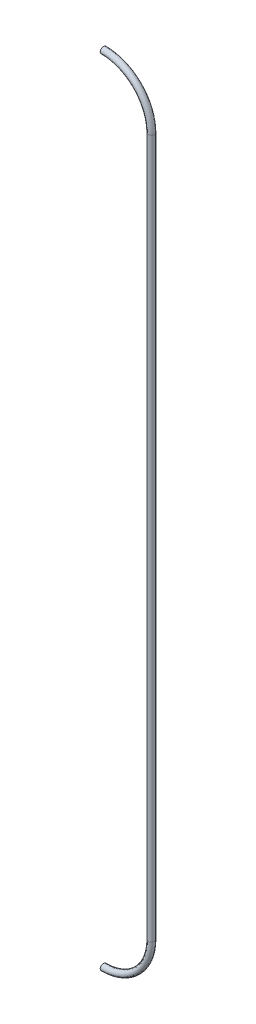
ISO-10303-21;
HEADER;
FILE_DESCRIPTION(('STEP AP214'),'2;1');
FILE_NAME('part.step','',(''),(''),'','','');
FILE_SCHEMA(('AUTOMOTIVE_DESIGN { 1 0 10303 214 1 1 1 1 }'));
ENDSEC;
DATA;
#1=APPLICATION_CONTEXT('core data for automotive mechanical design processes');
#2=APPLICATION_PROTOCOL_DEFINITION('international standard','automotive_design',2000,#1);
#3=PRODUCT_CONTEXT('',#1,'mechanical');
#4=PRODUCT('Part','Part','',(#3));
#5=PRODUCT_RELATED_PRODUCT_CATEGORY('part','',(#4));
#6=PRODUCT_DEFINITION_FORMATION('','',#4);
#7=PRODUCT_DEFINITION_CONTEXT('part definition',#1,'design');
#8=PRODUCT_DEFINITION('design','',#6,#7);
#9=PRODUCT_DEFINITION_SHAPE('','',#8);
#10=(LENGTH_UNIT() NAMED_UNIT(*) SI_UNIT(.MILLI.,.METRE.));
#11=(NAMED_UNIT(*) PLANE_ANGLE_UNIT() SI_UNIT($,.RADIAN.));
#12=(NAMED_UNIT(*) SI_UNIT($,.STERADIAN.) SOLID_ANGLE_UNIT());
#13=UNCERTAINTY_MEASURE_WITH_UNIT(LENGTH_MEASURE(1.E-05),#10,'distance_accuracy_value','');
#14=(GEOMETRIC_REPRESENTATION_CONTEXT(3) GLOBAL_UNCERTAINTY_ASSIGNED_CONTEXT((#13)) GLOBAL_UNIT_ASSIGNED_CONTEXT((#10,
#11,#12)) REPRESENTATION_CONTEXT('',''));
#15=CARTESIAN_POINT('',(0.,0.,0.));
#16=DIRECTION('',(0.,0.,1.));
#17=DIRECTION('',(1.,0.,0.));
#18=AXIS2_PLACEMENT_3D('',#15,#16,#17);
#19=CARTESIAN_POINT('',(126.,-1390.99444427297,0.));
#20=DIRECTION('',(-0.0111111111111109,-0.999938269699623,0.));
#21=DIRECTION('',(0.,0.,-1.));
#22=AXIS2_PLACEMENT_3D('',#19,#20,#21);
#23=CIRCLE('',#22,6.);
#24=CARTESIAN_POINT('',(36.,-1390.99444427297,0.));
#25=DIRECTION('',(0.,0.,-1.));
#26=AXIS1_PLACEMENT('',#24,#25);
#27=SURFACE_OF_REVOLUTION('',#23,#26);
#28=CARTESIAN_POINT('',(35.4964786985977,-1480.99303574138,-6.));
#29=CARTESIAN_POINT('',(35.4964775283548,-1481.16040589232,-6.00000256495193));
#30=CARTESIAN_POINT('',(35.4976648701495,-1481.32774129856,-5.99299396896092));
#31=CARTESIAN_POINT('',(35.5023765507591,-1481.66126006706,-5.96502084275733));
#32=CARTESIAN_POINT('',(35.5059013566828,-1481.82744319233,-5.94405352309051));
#33=CARTESIAN_POINT('',(35.5151892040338,-1482.15751646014,-5.88830446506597));
#34=CARTESIAN_POINT('',(35.5209536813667,-1482.32140506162,-5.85351386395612));
#35=CARTESIAN_POINT('',(35.5345547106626,-1482.64568234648,-5.77037219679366));
#36=CARTESIAN_POINT('',(35.5423920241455,-1482.80606972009,-5.72201614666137));
#37=CARTESIAN_POINT('',(35.5599002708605,-1483.12195956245,-5.61218124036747));
#38=CARTESIAN_POINT('',(35.569568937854,-1483.27746779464,-5.55071859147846));
#39=CARTESIAN_POINT('',(35.5904736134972,-1483.58278674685,-5.41506200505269));
#40=CARTESIAN_POINT('',(35.6017101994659,-1483.73259534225,-5.34086337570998));
#41=CARTESIAN_POINT('',(35.6254238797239,-1484.02535663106,-5.1803233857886));
#42=CARTESIAN_POINT('',(35.6379003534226,-1484.16831270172,-5.09398809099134));
#43=CARTESIAN_POINT('',(35.6637535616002,-1484.4465326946,-4.90971867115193));
#44=CARTESIAN_POINT('',(35.6771306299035,-1484.58179372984,-4.81178023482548));
#45=CARTESIAN_POINT('',(35.7045254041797,-1484.8447749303,-4.60412028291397));
#46=CARTESIAN_POINT('',(35.7185476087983,-1484.9724207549,-4.49430520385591));
#47=CARTESIAN_POINT('',(35.7467357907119,-1485.21807286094,-4.26430590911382));
#48=CARTESIAN_POINT('',(35.7609018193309,-1485.33607555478,-4.14411786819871));
#49=CARTESIAN_POINT('',(35.7889710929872,-1485.56154017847,-3.89427041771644));
#50=CARTESIAN_POINT('',(35.802874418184,-1485.669005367,-3.76461395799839));
#51=CARTESIAN_POINT('',(35.8300389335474,-1485.87272482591,-3.49663419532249));
#52=CARTESIAN_POINT('',(35.8432998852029,-1485.96897495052,-3.35830771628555));
#53=CARTESIAN_POINT('',(35.868867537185,-1486.14999487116,-3.07325850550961));
#54=CARTESIAN_POINT('',(35.8811690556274,-1486.23470395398,-2.92649674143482));
#55=CARTESIAN_POINT('',(35.9043981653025,-1486.39147295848,-2.62619078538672));
#56=CARTESIAN_POINT('',(35.9153252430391,-1486.46352815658,-2.47264408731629));
#57=CARTESIAN_POINT('',(35.9354845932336,-1486.59438622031,-2.15997135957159));
#58=CARTESIAN_POINT('',(35.9447175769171,-1486.65319464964,-2.00084770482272));
#59=CARTESIAN_POINT('',(35.9612334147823,-1486.75716991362,-1.67803962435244));
#60=CARTESIAN_POINT('',(35.9685155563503,-1486.80233176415,-1.51435355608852));
#61=CARTESIAN_POINT('',(35.9808567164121,-1486.87827032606,-1.18524494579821));
#62=CARTESIAN_POINT('',(35.985936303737,-1486.90918031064,-1.01985392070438));
#63=CARTESIAN_POINT('',(35.9938291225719,-1486.95700866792,-0.687005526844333));
#64=CARTESIAN_POINT('',(35.9966423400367,-1486.97392695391,-0.519548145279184));
#65=CARTESIAN_POINT('',(35.9999222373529,-1486.99363843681,-0.183793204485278));
#66=CARTESIAN_POINT('',(36.0003890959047,-1486.99643270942,-0.0154957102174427));
#67=CARTESIAN_POINT('',(35.9989639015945,-1486.98787895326,0.320729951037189));
#68=CARTESIAN_POINT('',(35.997071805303,-1486.97653066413,0.488658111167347));
#69=CARTESIAN_POINT('',(35.9910108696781,-1486.9399546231,0.821286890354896));
#70=CARTESIAN_POINT('',(35.9868646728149,-1486.91486488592,0.986003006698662));
#71=CARTESIAN_POINT('',(35.9764303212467,-1486.85110606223,1.31273004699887));
#72=CARTESIAN_POINT('',(35.9701414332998,-1486.81243232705,1.47474002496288));
#73=CARTESIAN_POINT('',(35.9483045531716,-1486.67642843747,1.95487577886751));
#74=CARTESIAN_POINT('',(35.9297795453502,-1486.55907731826,2.26745204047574));
#75=CARTESIAN_POINT('',(35.886720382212,-1486.27389038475,2.86970115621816));
#76=CARTESIAN_POINT('',(35.8621598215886,-1486.10583197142,3.15926576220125));
#77=CARTESIAN_POINT('',(35.8097561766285,-1485.7241248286,3.70633378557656));
#78=CARTESIAN_POINT('',(35.7819128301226,-1485.51047245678,3.96383463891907));
#79=CARTESIAN_POINT('',(35.7256452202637,-1485.04061260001,4.44266008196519));
#80=CARTESIAN_POINT('',(35.6972179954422,-1484.78392518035,4.66351343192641));
#81=CARTESIAN_POINT('',(35.6433061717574,-1484.23690178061,5.05912055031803));
#82=CARTESIAN_POINT('',(35.6178216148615,-1483.94656532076,5.23387366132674));
#83=CARTESIAN_POINT('',(35.5726643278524,-1483.33979268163,5.53249581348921));
#84=CARTESIAN_POINT('',(35.5530008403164,-1483.02331600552,5.65628405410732));
#85=CARTESIAN_POINT('',(35.5218357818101,-1482.37366310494,5.84882781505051));
#86=CARTESIAN_POINT('',(35.5103335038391,-1482.04048832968,5.91758810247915));
#87=CARTESIAN_POINT('',(35.4969333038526,-1481.37106358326,5.99744694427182));
#88=CARTESIAN_POINT('',(35.4949247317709,-1481.03489502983,6.00920984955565));
#89=CARTESIAN_POINT('',(35.5004496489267,-1480.36539846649,5.97648231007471));
#90=CARTESIAN_POINT('',(35.5079827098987,-1480.03207032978,5.93199439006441));
#91=CARTESIAN_POINT('',(35.531631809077,-1479.38011622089,5.78863572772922));
#92=CARTESIAN_POINT('',(35.547687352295,-1479.06140361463,5.69014813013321));
#93=CARTESIAN_POINT('',(35.5865228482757,-1478.445023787,5.44197382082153));
#94=CARTESIAN_POINT('',(35.6093031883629,-1478.14735777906,5.29228415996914));
#95=CARTESIAN_POINT('',(35.6592692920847,-1477.57864811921,4.94444268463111));
#96=CARTESIAN_POINT('',(35.6864916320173,-1477.30785840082,4.74588088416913));
#97=CARTESIAN_POINT('',(35.7421674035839,-1476.80319671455,4.30655902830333));
#98=CARTESIAN_POINT('',(35.7706209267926,-1476.56932749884,4.06579582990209));
#99=CARTESIAN_POINT('',(35.8259379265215,-1476.14244460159,3.54556155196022));
#100=CARTESIAN_POINT('',(35.8527807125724,-1475.9499035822,3.26569748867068));
#101=CARTESIAN_POINT('',(35.8893189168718,-1475.69848966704,2.8246657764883));
#102=CARTESIAN_POINT('',(35.9008824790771,-1475.62088666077,2.67403017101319));
#103=CARTESIAN_POINT('',(35.9224521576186,-1475.47865735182,2.36666439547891));
#104=CARTESIAN_POINT('',(35.9324588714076,-1475.41402606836,2.20993659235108));
#105=CARTESIAN_POINT('',(35.9505970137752,-1475.2984318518,1.89204790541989));
#106=CARTESIAN_POINT('',(35.9587348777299,-1475.24742191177,1.73090444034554));
#107=CARTESIAN_POINT('',(35.9729478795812,-1475.15916969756,1.40485953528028));
#108=CARTESIAN_POINT('',(35.979023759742,-1475.12192246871,1.23995947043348));
#109=CARTESIAN_POINT('',(35.9889436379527,-1475.06145943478,0.907520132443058));
#110=CARTESIAN_POINT('',(35.9927873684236,-1475.03824531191,0.739980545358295));
#111=CARTESIAN_POINT('',(35.9981317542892,-1475.00603886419,0.403507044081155));
#112=CARTESIAN_POINT('',(35.9996324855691,-1474.99704607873,0.234573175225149));
#113=CARTESIAN_POINT('',(36.0002443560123,-1474.99337505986,-0.101385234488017));
#114=CARTESIAN_POINT('',(35.9993845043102,-1474.99852305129,-0.268407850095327));
#115=CARTESIAN_POINT('',(35.9953612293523,-1475.02272281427,-0.601412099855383));
#116=CARTESIAN_POINT('',(35.9921978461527,-1475.04177434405,-0.767393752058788));
#117=CARTESIAN_POINT('',(35.9836552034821,-1475.09363826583,-1.09716458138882));
#118=CARTESIAN_POINT('',(35.978275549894,-1475.12645310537,-1.26095336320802));
#119=CARTESIAN_POINT('',(35.9654526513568,-1475.20557877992,-1.58509170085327));
#120=CARTESIAN_POINT('',(35.9580101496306,-1475.25188475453,-1.74544247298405));
#121=CARTESIAN_POINT('',(35.941273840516,-1475.35760770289,-2.06151979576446));
#122=CARTESIAN_POINT('',(35.9319815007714,-1475.41701428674,-2.21724990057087));
#123=CARTESIAN_POINT('',(35.9118016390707,-1475.54849975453,-2.52309018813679));
#124=CARTESIAN_POINT('',(35.9009146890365,-1475.6205740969,-2.67320236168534));
#125=CARTESIAN_POINT('',(35.8778371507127,-1475.7769236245,-2.9669026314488));
#126=CARTESIAN_POINT('',(35.8656460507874,-1475.8612036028,-3.11048813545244));
#127=CARTESIAN_POINT('',(35.8403016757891,-1476.04131960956,-3.39005496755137));
#128=CARTESIAN_POINT('',(35.8271487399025,-1476.13715157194,-3.52603894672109));
#129=CARTESIAN_POINT('',(35.8000737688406,-1476.34095536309,-3.79113252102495));
#130=CARTESIAN_POINT('',(35.786144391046,-1476.4490592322,-3.92013987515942));
#131=CARTESIAN_POINT('',(35.7580579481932,-1476.67566291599,-4.16856284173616));
#132=CARTESIAN_POINT('',(35.7439009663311,-1476.79415899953,-4.28798186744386));
#133=CARTESIAN_POINT('',(35.7157422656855,-1477.04084289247,-4.51652772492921));
#134=CARTESIAN_POINT('',(35.7017406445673,-1477.16903644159,-4.62564837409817));
#135=CARTESIAN_POINT('',(35.6743007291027,-1477.43412818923,-4.83271923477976));
#136=CARTESIAN_POINT('',(35.6608622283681,-1477.57102315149,-4.93067356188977));
#137=CARTESIAN_POINT('',(35.6348327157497,-1477.85361589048,-5.11541437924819));
#138=CARTESIAN_POINT('',(35.6222483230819,-1477.99936876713,-5.20211755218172));
#139=CARTESIAN_POINT('',(35.5984007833,-1478.2977220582,-5.36287846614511));
#140=CARTESIAN_POINT('',(35.5871371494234,-1478.45031992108,-5.4369408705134));
#141=CARTESIAN_POINT('',(35.5662625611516,-1478.76123306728,-5.5718605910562));
#142=CARTESIAN_POINT('',(35.5566504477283,-1478.91954424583,-5.63272717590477));
#143=CARTESIAN_POINT('',(35.5393541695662,-1479.24079631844,-5.74084427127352));
#144=CARTESIAN_POINT('',(35.5316695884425,-1479.40373620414,-5.78809772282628));
#145=CARTESIAN_POINT('',(35.5157284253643,-1479.8011631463,-5.88527187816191));
#146=CARTESIAN_POINT('',(35.5085444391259,-1480.03742763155,-5.92824626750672));
#147=CARTESIAN_POINT('',(35.4989204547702,-1480.51349712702,-5.98560824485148));
#148=CARTESIAN_POINT('',(35.4964803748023,-1480.75330207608,-5.99999632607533));
#149=CARTESIAN_POINT('',(35.4964786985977,-1480.99303574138,-6.));
#150=B_SPLINE_CURVE_WITH_KNOTS('',3,(#28,#29,#30,#31,#32,#33,#34,#35,#36,#37,#38,#39,#40,#41,
#42,#43,#44,#45,#46,#47,#48,#49,#50,#51,#52,#53,#54,#55,#56,#57,#58,#59,#60,#61,#62,#63,#64,#65,
#66,#67,#68,#69,#70,#71,#72,#73,#74,#75,#76,#77,#78,#79,#80,#81,#82,#83,#84,#85,#86,#87,#88,#89,
#90,#91,#92,#93,#94,#95,#96,#97,#98,#99,#100,#101,#102,#103,#104,#105,#106,#107,#108,#109,#110,
#111,#112,#113,#114,#115,#116,#117,#118,#119,#120,#121,#122,#123,#124,#125,#126,#127,#128,#129,
#130,#131,#132,#133,#134,#135,#136,#137,#138,#139,#140,#141,#142,#143,#144,#145,#146,#147,#148,
#149),.UNSPECIFIED.,.T.,.F.,(4,2,2,2,2,2,2,2,2,2,2,2,2,2,2,2,2,2,2,2,2,2,2,2,2,2,2,2,2,2,2,2,2,
2,2,2,2,2,2,2,2,2,2,2,2,2,2,2,2,2,2,2,2,2,2,2,2,2,2,2,4),(0.,0.501899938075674,1.00390020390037,
1.50622284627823,2.00873028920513,2.51061991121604,3.01269482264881,3.51451968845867,
4.01653160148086,4.5228346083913,5.02932512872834,5.53565852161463,6.04217849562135,
6.55126790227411,7.06054694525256,7.56961168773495,8.07886213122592,8.58324870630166,
9.08763840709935,9.59198969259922,10.0963502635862,10.5957356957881,11.0952921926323,
12.0933776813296,13.0959100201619,14.0985224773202,15.1131673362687,16.1278266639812,
17.1440885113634,18.1602623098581,19.1645628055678,20.1688182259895,21.1660386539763,
22.1633165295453,23.16926409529,24.1752866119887,25.1922649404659,25.7012957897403,
26.2101308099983,26.7171864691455,27.224059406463,27.7309930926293,28.2379103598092,
28.7386261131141,29.2393331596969,29.740129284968,30.2407452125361,30.740965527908,
31.24100687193,31.7412451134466,32.241307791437,32.7473794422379,33.2532701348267,
33.7594626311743,34.2654679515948,34.775029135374,35.2844019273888,35.7934157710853,
36.3023195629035,37.02123143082,37.7401308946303),.UNSPECIFIED.);
#151=CARTESIAN_POINT('',(35.4964786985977,-1480.99303574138,-6.));
#152=VERTEX_POINT('',#151);
#153=EDGE_CURVE('E52',#152,#152,#150,.T.);
#154=ORIENTED_EDGE('',*,*,#153,.F.);
#155=EDGE_LOOP('',(#154));
#156=FACE_BOUND('',#155,.T.);
#157=CARTESIAN_POINT('',(126.,-1390.99444427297,-6.));
#158=VERTEX_POINT('',#157);
#159=EDGE_CURVE('E10',#158,#158,#23,.T.);
#160=ORIENTED_EDGE('',*,*,#159,.T.);
#161=EDGE_LOOP('',(#160));
#162=FACE_BOUND('',#161,.T.);
#163=ADVANCED_FACE('F36',(#156,#162),#27,.F.);
#164=CARTESIAN_POINT('',(126.,-70.994444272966,0.));
#165=DIRECTION('',(-0.0111111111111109,-0.999938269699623,0.));
#166=DIRECTION('',(0.,0.,-1.));
#167=AXIS2_PLACEMENT_3D('',#164,#165,#166);
#168=CIRCLE('',#167,6.);
#169=DIRECTION('',(0.,-1.,0.));
#170=VECTOR('',#169,1.);
#171=SURFACE_OF_LINEAR_EXTRUSION('',#168,#170);
#172=CARTESIAN_POINT('',(126.,-70.994444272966,-6.));
#173=VERTEX_POINT('',#172);
#174=EDGE_CURVE('E48',#173,#173,#168,.T.);
#175=ORIENTED_EDGE('',*,*,#174,.T.);
#176=EDGE_LOOP('',(#175));
#177=FACE_BOUND('',#176,.T.);
#178=ORIENTED_EDGE('',*,*,#159,.F.);
#179=EDGE_LOOP('',(#178));
#180=FACE_BOUND('',#179,.T.);
#181=ADVANCED_FACE('F62',(#177,#180),#171,.T.);
#182=CARTESIAN_POINT('',(36.,-70.9944442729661,0.));
#183=DIRECTION('',(0.,0.,1.));
#184=AXIS1_PLACEMENT('',#182,#183);
#185=SURFACE_OF_REVOLUTION('',#168,#184);
#186=CARTESIAN_POINT('',(35.4964786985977,19.004147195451,-6.));
#187=CARTESIAN_POINT('',(35.4964775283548,19.1715173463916,-6.00000256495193));
#188=CARTESIAN_POINT('',(35.4976648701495,19.3388527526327,-5.99299396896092));
#189=CARTESIAN_POINT('',(35.5023765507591,19.6723715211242,-5.96502084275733));
#190=CARTESIAN_POINT('',(35.5059013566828,19.8385546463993,-5.94405352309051));
#191=CARTESIAN_POINT('',(35.5151892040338,20.1686279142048,-5.88830446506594));
#192=CARTESIAN_POINT('',(35.5209536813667,20.3325165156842,-5.85351386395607));
#193=CARTESIAN_POINT('',(35.5345547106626,20.6567938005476,-5.77037219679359));
#194=CARTESIAN_POINT('',(35.5423920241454,20.8171811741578,-5.72201614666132));
#195=CARTESIAN_POINT('',(35.5599002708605,21.1330710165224,-5.61218124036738));
#196=CARTESIAN_POINT('',(35.569568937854,21.2885792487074,-5.5507185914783));
#197=CARTESIAN_POINT('',(35.5904736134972,21.593898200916,-5.41506200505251));
#198=CARTESIAN_POINT('',(35.6017101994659,21.7437067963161,-5.34086337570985));
#199=CARTESIAN_POINT('',(35.6254238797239,22.0364680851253,-5.18032338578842));
#200=CARTESIAN_POINT('',(35.6379003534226,22.1794241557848,-5.09398809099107));
#201=CARTESIAN_POINT('',(35.6637535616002,22.4576441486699,-4.90971867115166));
#202=CARTESIAN_POINT('',(35.6771306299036,22.5929051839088,-4.81178023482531));
#203=CARTESIAN_POINT('',(35.7045254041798,22.8558863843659,-4.60412028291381));
#204=CARTESIAN_POINT('',(35.7185476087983,22.9835322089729,-4.49430520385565));
#205=CARTESIAN_POINT('',(35.7467357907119,23.2291843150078,-4.26430590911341));
#206=CARTESIAN_POINT('',(35.760901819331,23.347187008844,-4.14411786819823));
#207=CARTESIAN_POINT('',(35.7889710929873,23.5726516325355,-3.89427041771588));
#208=CARTESIAN_POINT('',(35.802874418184,23.6801168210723,-3.76461395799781));
#209=CARTESIAN_POINT('',(35.8300389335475,23.8838362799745,-3.4966341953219));
#210=CARTESIAN_POINT('',(35.8432998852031,23.9800864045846,-3.35830771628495));
#211=CARTESIAN_POINT('',(35.8688675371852,24.1611063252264,-3.073258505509));
#212=CARTESIAN_POINT('',(35.8811690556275,24.2458154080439,-2.92649674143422));
#213=CARTESIAN_POINT('',(35.9043981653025,24.4025844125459,-2.62619078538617));
#214=CARTESIAN_POINT('',(35.9153252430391,24.4746396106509,-2.47264408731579));
#215=CARTESIAN_POINT('',(35.9354845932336,24.6054976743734,-2.15997135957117));
#216=CARTESIAN_POINT('',(35.9447175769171,24.6643061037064,-2.00084770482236));
#217=CARTESIAN_POINT('',(35.9612334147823,24.7682813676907,-1.67803962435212));
#218=CARTESIAN_POINT('',(35.9685155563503,24.8134432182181,-1.51435355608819));
#219=CARTESIAN_POINT('',(35.9808567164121,24.8893817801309,-1.18524494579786));
#220=CARTESIAN_POINT('',(35.9859363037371,24.9202917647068,-1.01985392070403));
#221=CARTESIAN_POINT('',(35.9938291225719,24.9681201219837,-0.687005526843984));
#222=CARTESIAN_POINT('',(35.9966423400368,24.9850384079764,-0.519548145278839));
#223=CARTESIAN_POINT('',(35.9999222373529,25.0047498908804,-0.183793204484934));
#224=CARTESIAN_POINT('',(36.0003890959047,25.0075441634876,-0.0154957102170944));
#225=CARTESIAN_POINT('',(35.9989639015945,24.998990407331,0.320729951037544));
#226=CARTESIAN_POINT('',(35.997071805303,24.9876421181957,0.488658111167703));
#227=CARTESIAN_POINT('',(35.9910108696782,24.9510660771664,0.821286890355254));
#228=CARTESIAN_POINT('',(35.9868646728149,24.925976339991,0.98600300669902));
#229=CARTESIAN_POINT('',(35.9764303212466,24.8622175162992,1.31273004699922));
#230=CARTESIAN_POINT('',(35.9701414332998,24.8235437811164,1.47474002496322));
#231=CARTESIAN_POINT('',(35.9483045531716,24.6875398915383,1.95487577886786));
#232=CARTESIAN_POINT('',(35.9297795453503,24.5701887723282,2.26745204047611));
#233=CARTESIAN_POINT('',(35.8867203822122,24.2850018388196,2.86970115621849));
#234=CARTESIAN_POINT('',(35.8621598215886,24.1169434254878,3.15926576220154));
#235=CARTESIAN_POINT('',(35.8097561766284,23.7352362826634,3.70633378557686));
#236=CARTESIAN_POINT('',(35.7819128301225,23.5215839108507,3.96383463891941));
#237=CARTESIAN_POINT('',(35.7256452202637,23.0517240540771,4.44266008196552));
#238=CARTESIAN_POINT('',(35.6972179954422,22.7950366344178,4.66351343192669));
#239=CARTESIAN_POINT('',(35.6433061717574,22.24801323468,5.05912055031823));
#240=CARTESIAN_POINT('',(35.6178216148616,21.9576767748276,5.23387366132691));
#241=CARTESIAN_POINT('',(35.5726643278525,21.3509041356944,5.53249581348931));
#242=CARTESIAN_POINT('',(35.5530008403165,21.034427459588,5.65628405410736));
#243=CARTESIAN_POINT('',(35.52183578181,20.3847745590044,5.84882781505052));
#244=CARTESIAN_POINT('',(35.510333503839,20.0515997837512,5.91758810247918));
#245=CARTESIAN_POINT('',(35.4969333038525,19.3821750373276,5.99744694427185));
#246=CARTESIAN_POINT('',(35.4949247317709,19.046006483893,6.00920984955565));
#247=CARTESIAN_POINT('',(35.5004496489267,18.3765099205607,5.97648231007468));
#248=CARTESIAN_POINT('',(35.5079827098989,18.04318178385,5.93199439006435));
#249=CARTESIAN_POINT('',(35.5316318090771,17.3912276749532,5.78863572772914));
#250=CARTESIAN_POINT('',(35.5476873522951,17.0725150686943,5.69014813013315));
#251=CARTESIAN_POINT('',(35.5865228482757,16.4561352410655,5.44197382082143));
#252=CARTESIAN_POINT('',(35.6093031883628,16.1584692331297,5.29228415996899));
#253=CARTESIAN_POINT('',(35.6592692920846,15.5897595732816,4.94444268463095));
#254=CARTESIAN_POINT('',(35.6864916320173,15.3189698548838,4.74588088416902));
#255=CARTESIAN_POINT('',(35.7421674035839,14.8143081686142,4.30655902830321));
#256=CARTESIAN_POINT('',(35.7706209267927,14.5804389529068,4.0657958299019));
#257=CARTESIAN_POINT('',(35.8259379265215,14.1535560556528,3.54556155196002));
#258=CARTESIAN_POINT('',(35.8527807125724,13.9610150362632,3.26569748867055));
#259=CARTESIAN_POINT('',(35.8893189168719,13.709601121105,2.82466577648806));
#260=CARTESIAN_POINT('',(35.9008824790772,13.631998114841,2.67403017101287));
#261=CARTESIAN_POINT('',(35.9224521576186,13.4897688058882,2.36666439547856));
#262=CARTESIAN_POINT('',(35.9324588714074,13.4251375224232,2.20993659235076));
#263=CARTESIAN_POINT('',(35.950597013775,13.3095433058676,1.89204790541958));
#264=CARTESIAN_POINT('',(35.9587348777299,13.2585333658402,1.73090444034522));
#265=CARTESIAN_POINT('',(35.9729478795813,13.1702811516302,1.40485953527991));
#266=CARTESIAN_POINT('',(35.979023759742,13.1330339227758,1.23995947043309));
#267=CARTESIAN_POINT('',(35.9889436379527,13.0725708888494,0.90752013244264));
#268=CARTESIAN_POINT('',(35.9927873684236,13.049356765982,0.739980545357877));
#269=CARTESIAN_POINT('',(35.9981317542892,13.017150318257,0.403507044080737));
#270=CARTESIAN_POINT('',(35.9996324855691,13.0081575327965,0.234573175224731));
#271=CARTESIAN_POINT('',(36.0002443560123,13.0044865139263,-0.101385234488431));
#272=CARTESIAN_POINT('',(35.9993845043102,13.0096345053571,-0.268407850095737));
#273=CARTESIAN_POINT('',(35.9953612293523,13.0338342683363,-0.601412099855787));
#274=CARTESIAN_POINT('',(35.9921978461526,13.0528857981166,-0.767393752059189));
#275=CARTESIAN_POINT('',(35.9836552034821,13.1047497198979,-1.09716458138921));
#276=CARTESIAN_POINT('',(35.9782755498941,13.1375645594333,-1.2609533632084));
#277=CARTESIAN_POINT('',(35.9654526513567,13.216690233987,-1.58509170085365));
#278=CARTESIAN_POINT('',(35.9580101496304,13.2629962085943,-1.74544247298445));
#279=CARTESIAN_POINT('',(35.9412738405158,13.3687191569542,-2.06151979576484));
#280=CARTESIAN_POINT('',(35.9319815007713,13.4281257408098,-2.21724990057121));
#281=CARTESIAN_POINT('',(35.9118016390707,13.5596112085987,-2.5230901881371));
#282=CARTESIAN_POINT('',(35.9009146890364,13.6316855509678,-2.67320236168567));
#283=CARTESIAN_POINT('',(35.8778371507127,13.7880350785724,-2.96690263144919));
#284=CARTESIAN_POINT('',(35.8656460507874,13.8723150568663,-3.11048813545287));
#285=CARTESIAN_POINT('',(35.8403016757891,14.052431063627,-3.3900549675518));
#286=CARTESIAN_POINT('',(35.8271487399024,14.1482630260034,-3.52603894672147));
#287=CARTESIAN_POINT('',(35.8000737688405,14.3520668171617,-3.79113252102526));
#288=CARTESIAN_POINT('',(35.786144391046,14.460170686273,-3.9201398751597));
#289=CARTESIAN_POINT('',(35.7580579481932,14.6867743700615,-4.16856284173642));
#290=CARTESIAN_POINT('',(35.7439009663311,14.8052704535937,-4.28798186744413));
#291=CARTESIAN_POINT('',(35.7157422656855,15.0519543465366,-4.51652772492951));
#292=CARTESIAN_POINT('',(35.7017406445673,15.1801478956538,-4.6256483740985));
#293=CARTESIAN_POINT('',(35.6743007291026,15.4452396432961,-4.83271923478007));
#294=CARTESIAN_POINT('',(35.6608622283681,15.5821346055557,-4.93067356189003));
#295=CARTESIAN_POINT('',(35.6348327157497,15.8647273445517,-5.11541437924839));
#296=CARTESIAN_POINT('',(35.6222483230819,16.0104802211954,-5.20211755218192));
#297=CARTESIAN_POINT('',(35.5984007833,16.3088335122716,-5.36287846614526));
#298=CARTESIAN_POINT('',(35.5871371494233,16.4614313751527,-5.43694087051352));
#299=CARTESIAN_POINT('',(35.5662625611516,16.7723445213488,-5.57186059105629));
#300=CARTESIAN_POINT('',(35.5566504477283,16.9306556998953,-5.6327271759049));
#301=CARTESIAN_POINT('',(35.5393541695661,17.2519077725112,-5.74084427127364));
#302=CARTESIAN_POINT('',(35.5316695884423,17.414847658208,-5.78809772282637));
#303=CARTESIAN_POINT('',(35.5157284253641,17.8122746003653,-5.88527187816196));
#304=CARTESIAN_POINT('',(35.5085444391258,18.0485390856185,-5.92824626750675));
#305=CARTESIAN_POINT('',(35.4989204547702,18.5246085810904,-5.98560824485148));
#306=CARTESIAN_POINT('',(35.4964803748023,18.7644135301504,-5.99999632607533));
#307=CARTESIAN_POINT('',(35.4964786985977,19.004147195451,-6.));
#308=B_SPLINE_CURVE_WITH_KNOTS('',3,(#186,#187,#188,#189,#190,#191,#192,#193,#194,#195,#196,
#197,#198,#199,#200,#201,#202,#203,#204,#205,#206,#207,#208,#209,#210,#211,#212,#213,#214,#215,
#216,#217,#218,#219,#220,#221,#222,#223,#224,#225,#226,#227,#228,#229,#230,#231,#232,#233,#234,
#235,#236,#237,#238,#239,#240,#241,#242,#243,#244,#245,#246,#247,#248,#249,#250,#251,#252,#253,
#254,#255,#256,#257,#258,#259,#260,#261,#262,#263,#264,#265,#266,#267,#268,#269,#270,#271,#272,
#273,#274,#275,#276,#277,#278,#279,#280,#281,#282,#283,#284,#285,#286,#287,#288,#289,#290,#291,
#292,#293,#294,#295,#296,#297,#298,#299,#300,#301,#302,#303,#304,#305,#306,#307),.UNSPECIFIED.,
.T.,.F.,(4,2,2,2,2,2,2,2,2,2,2,2,2,2,2,2,2,2,2,2,2,2,2,2,2,2,2,2,2,2,2,2,2,2,2,2,2,2,2,2,2,2,2,
2,2,2,2,2,2,2,2,2,2,2,2,2,2,2,2,2,4),(0.,0.501899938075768,1.00390020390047,1.50622284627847,
2.00873028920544,2.51061991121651,3.01269482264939,3.51451968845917,4.01653160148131,
4.52283460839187,5.02932512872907,5.53565852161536,6.04217849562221,6.55126790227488,
7.06054694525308,7.5696116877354,8.07886213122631,8.58324870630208,9.08763840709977,
9.59198969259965,10.0963502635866,10.5957356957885,11.0952921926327,12.0933776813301,
13.0959100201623,14.0985224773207,15.1131673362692,16.1278266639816,17.1440885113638,
18.1602623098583,19.164562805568,20.1688182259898,21.1660386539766,22.1633165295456,
23.1692640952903,24.175286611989,25.1922649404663,25.7012957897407,26.2101308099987,
26.7171864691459,27.2240594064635,27.7309930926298,28.2379103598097,28.7386261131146,
29.2393331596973,29.7401292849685,30.2407452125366,30.7409655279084,31.2410068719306,
31.7412451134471,32.2413077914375,32.7473794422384,33.2532701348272,33.7594626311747,
34.2654679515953,34.7750291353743,35.2844019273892,35.7934157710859,36.3023195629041,
37.0212314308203,37.7401308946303),.UNSPECIFIED.);
#309=CARTESIAN_POINT('',(35.4964786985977,19.004147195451,-6.));
#310=VERTEX_POINT('',#309);
#311=EDGE_CURVE('E41',#310,#310,#308,.T.);
#312=ORIENTED_EDGE('',*,*,#311,.T.);
#313=EDGE_LOOP('',(#312));
#314=FACE_BOUND('',#313,.T.);
#315=ORIENTED_EDGE('',*,*,#174,.F.);
#316=EDGE_LOOP('',(#315));
#317=FACE_BOUND('',#316,.T.);
#318=ADVANCED_FACE('F60',(#314,#317),#185,.T.);
#319=CARTESIAN_POINT('',(0.,-1486.9940970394,0.));
#320=DIRECTION('',(0.,1.,0.));
#321=DIRECTION('',(0.,0.,1.));
#322=AXIS2_PLACEMENT_3D('',#319,#320,#321);
#323=CYLINDRICAL_SURFACE('',#322,36.);
#324=ORIENTED_EDGE('',*,*,#311,.F.);
#325=EDGE_LOOP('',(#324));
#326=FACE_BOUND('',#325,.T.);
#327=ADVANCED_FACE('F69',(#326),#323,.F.);
#328=ORIENTED_EDGE('',*,*,#153,.T.);
#329=EDGE_LOOP('',(#328));
#330=FACE_BOUND('',#329,.T.);
#331=ADVANCED_FACE('F84',(#330),#323,.F.);
#332=CLOSED_SHELL('',(#163,#181,#318,#327,#331));
#333=MANIFOLD_SOLID_BREP('B2',#332);
#334=ADVANCED_BREP_SHAPE_REPRESENTATION('',(#18,#333),#14);
#335=SHAPE_DEFINITION_REPRESENTATION(#9,#334);
ENDSEC;
END-ISO-10303-21;
